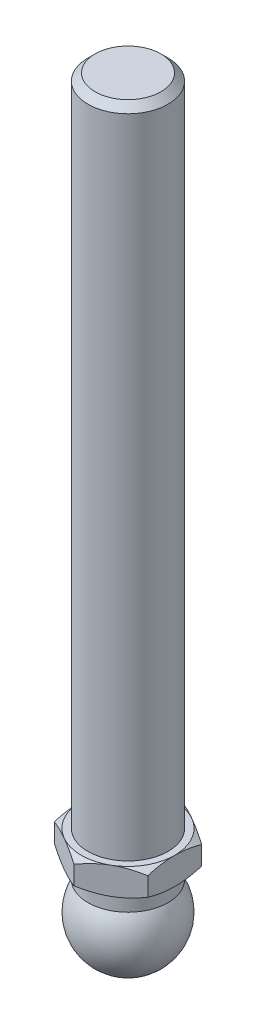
ISO-10303-21;
HEADER;
FILE_DESCRIPTION(('STEP AP214'),'2;1');
FILE_NAME('part.step','',(''),(''),'','','');
FILE_SCHEMA(('AUTOMOTIVE_DESIGN { 1 0 10303 214 1 1 1 1 }'));
ENDSEC;
DATA;
#1=APPLICATION_CONTEXT('core data for automotive mechanical design processes');
#2=APPLICATION_PROTOCOL_DEFINITION('international standard','automotive_design',2000,#1);
#3=PRODUCT_CONTEXT('',#1,'mechanical');
#4=PRODUCT('Part','Part','',(#3));
#5=PRODUCT_RELATED_PRODUCT_CATEGORY('part','',(#4));
#6=PRODUCT_DEFINITION_FORMATION('','',#4);
#7=PRODUCT_DEFINITION_CONTEXT('part definition',#1,'design');
#8=PRODUCT_DEFINITION('design','',#6,#7);
#9=PRODUCT_DEFINITION_SHAPE('','',#8);
#10=(LENGTH_UNIT() NAMED_UNIT(*) SI_UNIT(.MILLI.,.METRE.));
#11=(NAMED_UNIT(*) PLANE_ANGLE_UNIT() SI_UNIT($,.RADIAN.));
#12=(NAMED_UNIT(*) SI_UNIT($,.STERADIAN.) SOLID_ANGLE_UNIT());
#13=UNCERTAINTY_MEASURE_WITH_UNIT(LENGTH_MEASURE(1.E-05),#10,'distance_accuracy_value','');
#14=(GEOMETRIC_REPRESENTATION_CONTEXT(3) GLOBAL_UNCERTAINTY_ASSIGNED_CONTEXT((#13)) GLOBAL_UNIT_ASSIGNED_CONTEXT((#10,
#11,#12)) REPRESENTATION_CONTEXT('',''));
#15=CARTESIAN_POINT('',(0.,0.,0.));
#16=DIRECTION('',(0.,0.,1.));
#17=DIRECTION('',(1.,0.,0.));
#18=AXIS2_PLACEMENT_3D('',#15,#16,#17);
#19=CARTESIAN_POINT('',(0.,10.85,0.));
#20=DIRECTION('',(0.,-1.,0.));
#21=DIRECTION('',(0.,0.,-1.));
#22=AXIS2_PLACEMENT_3D('',#19,#20,#21);
#23=CONICAL_SURFACE('',#22,7.,1.0471975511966);
#24=CARTESIAN_POINT('',(-7.,6.78828268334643,12.1648696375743));
#25=CARTESIAN_POINT('',(-7.,6.93391573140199,11.8738003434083));
#26=CARTESIAN_POINT('',(-7.,7.07854589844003,11.5822239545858));
#27=CARTESIAN_POINT('',(-7.,7.36531569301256,10.997825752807));
#28=CARTESIAN_POINT('',(-7.,7.50745515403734,10.7050038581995));
#29=CARTESIAN_POINT('',(-7.,7.78902214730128,10.117331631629));
#30=CARTESIAN_POINT('',(-7.,7.92844364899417,9.82247840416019));
#31=CARTESIAN_POINT('',(-7.,8.20360604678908,9.23106328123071));
#32=CARTESIAN_POINT('',(-7.,8.33934701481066,8.9345014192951));
#33=CARTESIAN_POINT('',(-7.,8.61231104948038,8.325935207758));
#34=CARTESIAN_POINT('',(-7.,8.74932547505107,8.01383696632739));
#35=CARTESIAN_POINT('',(-7.,9.01713837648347,7.3869579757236));
#36=CARTESIAN_POINT('',(-7.,9.1479365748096,7.07217710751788));
#37=CARTESIAN_POINT('',(-7.,9.40155301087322,6.43962449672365));
#38=CARTESIAN_POINT('',(-7.,9.52437615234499,6.12185473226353));
#39=CARTESIAN_POINT('',(-7.,9.7599016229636,5.48260317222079));
#40=CARTESIAN_POINT('',(-7.,9.87260505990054,5.16112178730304));
#41=CARTESIAN_POINT('',(-7.,10.1099014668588,4.43821731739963));
#42=CARTESIAN_POINT('',(-7.,10.231118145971,4.03566892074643));
#43=CARTESIAN_POINT('',(-7.,10.4469740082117,3.22331060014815));
#44=CARTESIAN_POINT('',(-7.,10.5416155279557,2.81350131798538));
#45=CARTESIAN_POINT('',(-7.,10.6569999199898,2.19742561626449));
#46=CARTESIAN_POINT('',(-7.,10.6908518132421,1.99359214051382));
#47=CARTESIAN_POINT('',(-7.,10.7493191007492,1.5846161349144));
#48=CARTESIAN_POINT('',(-7.,10.7739358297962,1.37947379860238));
#49=CARTESIAN_POINT('',(-7.,10.8131968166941,0.968289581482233));
#50=CARTESIAN_POINT('',(-7.,10.8278439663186,0.762247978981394));
#51=CARTESIAN_POINT('',(-7.,10.8467021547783,0.349683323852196));
#52=CARTESIAN_POINT('',(-7.,10.8509132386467,0.143160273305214));
#53=CARTESIAN_POINT('',(-7.,10.8487493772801,-0.271082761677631));
#54=CARTESIAN_POINT('',(-7.,10.8423100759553,-0.478802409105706));
#55=CARTESIAN_POINT('',(-7.,10.8189433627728,-0.893645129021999));
#56=CARTESIAN_POINT('',(-7.,10.8020159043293,-1.10076819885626));
#57=CARTESIAN_POINT('',(-7.,10.7582124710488,-1.51403043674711));
#58=CARTESIAN_POINT('',(-7.,10.7313327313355,-1.72016920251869));
#59=CARTESIAN_POINT('',(-7.,10.6684180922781,-2.13103319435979));
#60=CARTESIAN_POINT('',(-7.,10.6323828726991,-2.33575837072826));
#61=CARTESIAN_POINT('',(-7.,10.5105686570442,-2.95437912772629));
#62=CARTESIAN_POINT('',(-7.,10.4118729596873,-3.36575077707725));
#63=CARTESIAN_POINT('',(-7.,10.1884533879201,-4.18138012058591));
#64=CARTESIAN_POINT('',(-7.,10.0637148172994,-4.58563365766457));
#65=CARTESIAN_POINT('',(-7.,9.82332483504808,-5.30320893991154));
#66=CARTESIAN_POINT('',(-7.,9.71128759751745,-5.61775957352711));
#67=CARTESIAN_POINT('',(-7.,9.47785144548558,-6.24325021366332));
#68=CARTESIAN_POINT('',(-7.,9.35645511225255,-6.55419118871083));
#69=CARTESIAN_POINT('',(-7.,9.1062070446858,-7.17328528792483));
#70=CARTESIAN_POINT('',(-7.,8.9773503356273,-7.48143638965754));
#71=CARTESIAN_POINT('',(-7.,8.71378231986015,-8.09523802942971));
#72=CARTESIAN_POINT('',(-7.,8.57907065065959,-8.40088841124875));
#73=CARTESIAN_POINT('',(-7.,8.31078407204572,-8.99716345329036));
#74=CARTESIAN_POINT('',(-7.,8.17740317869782,-9.28787568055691));
#75=CARTESIAN_POINT('',(-7.,7.90714715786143,-9.86766295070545));
#76=CARTESIAN_POINT('',(-7.,7.77027208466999,-10.1567380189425));
#77=CARTESIAN_POINT('',(-7.,7.49389786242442,-10.7329937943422));
#78=CARTESIAN_POINT('',(-7.,7.35440383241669,-11.0201769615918));
#79=CARTESIAN_POINT('',(-7.,7.07302286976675,-11.5933594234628));
#80=CARTESIAN_POINT('',(-7.,6.93113600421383,-11.879358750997));
#81=CARTESIAN_POINT('',(-7.,6.78828268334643,-12.1648696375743));
#82=B_SPLINE_CURVE_WITH_KNOTS('',3,(#24,#25,#26,#27,#28,#29,#30,#31,#32,#33,#34,#35,#36,#37,#38,
#39,#40,#41,#42,#43,#44,#45,#46,#47,#48,#49,#50,#51,#52,#53,#54,#55,#56,#57,#58,#59,#60,#61,#62,
#63,#64,#65,#66,#67,#68,#69,#70,#71,#72,#73,#74,#75,#76,#77,#78,#79,#80,#81),.UNSPECIFIED.,.F.,
.F.,(4,2,2,2,2,2,2,2,2,2,2,2,2,2,2,2,2,2,2,2,2,2,2,2,2,2,2,2,4),(0.,0.976413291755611,
1.95289161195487,2.93133423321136,3.90975772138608,4.93225217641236,5.95479223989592,
6.97669748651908,7.99849072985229,9.25906449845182,10.5195273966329,11.1392271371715,
11.7588372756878,12.3782676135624,12.9976952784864,13.6208795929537,14.2440666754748,
14.8674897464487,15.490934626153,16.758797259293,18.027377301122,19.0289263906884,
20.0302002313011,21.0321496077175,22.0341611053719,22.9936838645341,23.9531917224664,
24.9109871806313,25.8687558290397),.UNSPECIFIED.);
#83=CARTESIAN_POINT('',(-7.,10.2247852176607,4.04145188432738));
#84=VERTEX_POINT('',#83);
#85=CARTESIAN_POINT('',(-7.,10.85,0.));
#86=VERTEX_POINT('',#85);
#87=EDGE_CURVE('E313',#84,#86,#82,.T.);
#88=ORIENTED_EDGE('',*,*,#87,.F.);
#89=CARTESIAN_POINT('',(0.000200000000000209,10.2247185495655,8.0830192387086));
#90=CARTESIAN_POINT('',(-0.153667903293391,10.2760001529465,7.99418356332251));
#91=CARTESIAN_POINT('',(-0.30810950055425,10.3249544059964,7.90501666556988));
#92=CARTESIAN_POINT('',(-0.618246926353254,10.4175672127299,7.72595873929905));
#93=CARTESIAN_POINT('',(-0.773943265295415,10.4612234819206,7.63606741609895));
#94=CARTESIAN_POINT('',(-1.24352516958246,10.5833884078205,7.36495417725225));
#95=CARTESIAN_POINT('',(-1.5592643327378,10.652874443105,7.18266208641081));
#96=CARTESIAN_POINT('',(-2.03176224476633,10.7343550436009,6.9098652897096));
#97=CARTESIAN_POINT('',(-2.18710922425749,10.7575665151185,6.82017566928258));
#98=CARTESIAN_POINT('',(-2.49850511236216,10.7964887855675,6.64039116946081));
#99=CARTESIAN_POINT('',(-2.65455395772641,10.8122002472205,6.55029632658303));
#100=CARTESIAN_POINT('',(-2.96692267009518,10.8357220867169,6.36995016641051));
#101=CARTESIAN_POINT('',(-3.12324202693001,10.8435414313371,6.27969914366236));
#102=CARTESIAN_POINT('',(-3.43601650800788,10.8511197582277,6.09911871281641));
#103=CARTESIAN_POINT('',(-3.59247162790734,10.850878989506,6.00878930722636));
#104=CARTESIAN_POINT('',(-4.02110687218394,10.8391402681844,5.76131663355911));
#105=CARTESIAN_POINT('',(-4.2931466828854,10.8194342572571,5.60425437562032));
#106=CARTESIAN_POINT('',(-4.8354194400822,10.7569465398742,5.29117305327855));
#107=CARTESIAN_POINT('',(-5.10565047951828,10.714143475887,5.13515508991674));
#108=CARTESIAN_POINT('',(-5.64901454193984,10.6071483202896,4.82144370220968));
#109=CARTESIAN_POINT('',(-5.92207900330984,10.5425029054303,4.66378986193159));
#110=CARTESIAN_POINT('',(-6.46413578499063,10.395783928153,4.35083323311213));
#111=CARTESIAN_POINT('',(-6.73313504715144,10.3137448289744,4.19552643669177));
#112=CARTESIAN_POINT('',(-7.0002,10.2247185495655,4.04133641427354));
#113=B_SPLINE_CURVE_WITH_KNOTS('',3,(#89,#90,#91,#92,#93,#94,#95,#96,#97,#98,#99,#100,#101,#102,
#103,#104,#105,#106,#107,#108,#109,#110,#111,#112),.UNSPECIFIED.,.F.,.F.,(4,2,2,2,2,2,2,2,2,2,2,
4),(0.,0.554727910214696,1.10969417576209,2.2219327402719,2.76443041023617,3.30688013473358,
3.8487128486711,4.3905288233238,5.33376515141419,6.27787517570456,7.2429241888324,
8.20607866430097),.UNSPECIFIED.);
#114=CARTESIAN_POINT('',(-3.5,10.85,6.06217782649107));
#115=VERTEX_POINT('',#114);
#116=EDGE_CURVE('E135',#115,#84,#113,.T.);
#117=ORIENTED_EDGE('',*,*,#116,.F.);
#118=CARTESIAN_POINT('',(0.,10.85,0.));
#119=DIRECTION('',(0.,-1.,0.));
#120=DIRECTION('',(0.,0.,-1.));
#121=AXIS2_PLACEMENT_3D('',#118,#119,#120);
#122=CIRCLE('',#121,7.);
#123=EDGE_CURVE('E283',#115,#86,#122,.T.);
#124=ORIENTED_EDGE('',*,*,#123,.T.);
#125=EDGE_LOOP('',(#88,#117,#124));
#126=FACE_BOUND('',#125,.T.);
#127=ADVANCED_FACE('F14',(#126),#23,.T.);
#128=CARTESIAN_POINT('',(-7.,10.2247852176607,-4.04145188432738));
#129=VERTEX_POINT('',#128);
#130=EDGE_CURVE('E193',#86,#129,#82,.T.);
#131=ORIENTED_EDGE('',*,*,#130,.F.);
#132=CARTESIAN_POINT('',(-3.5,10.85,-6.06217782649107));
#133=VERTEX_POINT('',#132);
#134=EDGE_CURVE('E195',#86,#133,#122,.T.);
#135=ORIENTED_EDGE('',*,*,#134,.T.);
#136=CARTESIAN_POINT('',(-7.0002,10.2247185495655,-4.04133641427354));
#137=CARTESIAN_POINT('',(-6.84633209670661,10.2760001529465,-4.13017208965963));
#138=CARTESIAN_POINT('',(-6.69189049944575,10.3249544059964,-4.21933898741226));
#139=CARTESIAN_POINT('',(-6.38175307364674,10.4175672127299,-4.39839691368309));
#140=CARTESIAN_POINT('',(-6.22605673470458,10.4612234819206,-4.48828823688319));
#141=CARTESIAN_POINT('',(-5.75647483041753,10.5833884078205,-4.75940147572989));
#142=CARTESIAN_POINT('',(-5.4407356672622,10.652874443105,-4.94169356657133));
#143=CARTESIAN_POINT('',(-4.96823775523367,10.7343550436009,-5.21449036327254));
#144=CARTESIAN_POINT('',(-4.81289077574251,10.7575665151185,-5.30417998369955));
#145=CARTESIAN_POINT('',(-4.50149488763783,10.7964887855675,-5.48396448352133));
#146=CARTESIAN_POINT('',(-4.34544604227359,10.8122002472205,-5.57405932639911));
#147=CARTESIAN_POINT('',(-4.03307732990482,10.8357220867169,-5.75440548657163));
#148=CARTESIAN_POINT('',(-3.87675797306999,10.8435414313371,-5.84465650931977));
#149=CARTESIAN_POINT('',(-3.56398349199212,10.8511197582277,-6.02523694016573));
#150=CARTESIAN_POINT('',(-3.40752837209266,10.850878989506,-6.11556634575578));
#151=CARTESIAN_POINT('',(-2.97889312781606,10.8391402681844,-6.36303901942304));
#152=CARTESIAN_POINT('',(-2.7068533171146,10.8194342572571,-6.52010127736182));
#153=CARTESIAN_POINT('',(-2.1645805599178,10.7569465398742,-6.83318259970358));
#154=CARTESIAN_POINT('',(-1.89434952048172,10.714143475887,-6.9892005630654));
#155=CARTESIAN_POINT('',(-1.35098545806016,10.6071483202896,-7.30291195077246));
#156=CARTESIAN_POINT('',(-1.07792099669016,10.5425029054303,-7.46056579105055));
#157=CARTESIAN_POINT('',(-0.535864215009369,10.395783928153,-7.77352241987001));
#158=CARTESIAN_POINT('',(-0.266864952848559,10.3137448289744,-7.92882921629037));
#159=CARTESIAN_POINT('',(0.000200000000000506,10.2247185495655,-8.0830192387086));
#160=B_SPLINE_CURVE_WITH_KNOTS('',3,(#136,#137,#138,#139,#140,#141,#142,#143,#144,#145,#146,
#147,#148,#149,#150,#151,#152,#153,#154,#155,#156,#157,#158,#159),.UNSPECIFIED.,.F.,.F.,(4,2,2,
2,2,2,2,2,2,2,2,4),(0.,0.554727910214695,1.10969417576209,2.2219327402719,2.76443041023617,
3.30688013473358,3.8487128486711,4.39052882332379,5.33376515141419,6.27787517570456,
7.2429241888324,8.20607866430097),.UNSPECIFIED.);
#161=EDGE_CURVE('E183',#129,#133,#160,.T.);
#162=ORIENTED_EDGE('',*,*,#161,.F.);
#163=EDGE_LOOP('',(#131,#135,#162));
#164=FACE_BOUND('',#163,.T.);
#165=ADVANCED_FACE('F192',(#164),#23,.T.);
#166=CARTESIAN_POINT('',(0.,10.2247852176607,-8.08290376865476));
#167=VERTEX_POINT('',#166);
#168=EDGE_CURVE('E197',#133,#167,#160,.T.);
#169=ORIENTED_EDGE('',*,*,#168,.F.);
#170=CARTESIAN_POINT('',(3.5,10.85,-6.06217782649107));
#171=VERTEX_POINT('',#170);
#172=EDGE_CURVE('E293',#133,#171,#122,.T.);
#173=ORIENTED_EDGE('',*,*,#172,.T.);
#174=CARTESIAN_POINT('',(-0.000200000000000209,10.2247185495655,-8.0830192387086));
#175=CARTESIAN_POINT('',(0.153667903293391,10.2760001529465,-7.99418356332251));
#176=CARTESIAN_POINT('',(0.30810950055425,10.3249544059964,-7.90501666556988));
#177=CARTESIAN_POINT('',(0.618246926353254,10.4175672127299,-7.72595873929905));
#178=CARTESIAN_POINT('',(0.773943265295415,10.4612234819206,-7.63606741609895));
#179=CARTESIAN_POINT('',(1.24352516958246,10.5833884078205,-7.36495417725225));
#180=CARTESIAN_POINT('',(1.5592643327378,10.652874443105,-7.18266208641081));
#181=CARTESIAN_POINT('',(2.03176224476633,10.7343550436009,-6.9098652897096));
#182=CARTESIAN_POINT('',(2.18710922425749,10.7575665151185,-6.82017566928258));
#183=CARTESIAN_POINT('',(2.49850511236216,10.7964887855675,-6.64039116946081));
#184=CARTESIAN_POINT('',(2.65455395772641,10.8122002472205,-6.55029632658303));
#185=CARTESIAN_POINT('',(2.96692267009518,10.8357220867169,-6.36995016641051));
#186=CARTESIAN_POINT('',(3.12324202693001,10.8435414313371,-6.27969914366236));
#187=CARTESIAN_POINT('',(3.43601650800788,10.8511197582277,-6.09911871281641));
#188=CARTESIAN_POINT('',(3.59247162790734,10.850878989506,-6.00878930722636));
#189=CARTESIAN_POINT('',(4.02110687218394,10.8391402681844,-5.76131663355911));
#190=CARTESIAN_POINT('',(4.2931466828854,10.8194342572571,-5.60425437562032));
#191=CARTESIAN_POINT('',(4.8354194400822,10.7569465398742,-5.29117305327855));
#192=CARTESIAN_POINT('',(5.10565047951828,10.714143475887,-5.13515508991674));
#193=CARTESIAN_POINT('',(5.64901454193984,10.6071483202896,-4.82144370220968));
#194=CARTESIAN_POINT('',(5.92207900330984,10.5425029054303,-4.66378986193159));
#195=CARTESIAN_POINT('',(6.46413578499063,10.395783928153,-4.35083323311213));
#196=CARTESIAN_POINT('',(6.73313504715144,10.3137448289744,-4.19552643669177));
#197=CARTESIAN_POINT('',(7.0002,10.2247185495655,-4.04133641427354));
#198=B_SPLINE_CURVE_WITH_KNOTS('',3,(#174,#175,#176,#177,#178,#179,#180,#181,#182,#183,#184,
#185,#186,#187,#188,#189,#190,#191,#192,#193,#194,#195,#196,#197),.UNSPECIFIED.,.F.,.F.,(4,2,2,
2,2,2,2,2,2,2,2,4),(0.,0.554727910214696,1.10969417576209,2.2219327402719,2.76443041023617,
3.30688013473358,3.8487128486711,4.3905288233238,5.33376515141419,6.27787517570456,
7.2429241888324,8.20607866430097),.UNSPECIFIED.);
#199=EDGE_CURVE('E243',#167,#171,#198,.T.);
#200=ORIENTED_EDGE('',*,*,#199,.F.);
#201=EDGE_LOOP('',(#169,#173,#200));
#202=FACE_BOUND('',#201,.T.);
#203=ADVANCED_FACE('F346',(#202),#23,.T.);
#204=CARTESIAN_POINT('',(7.,10.2247852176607,-4.04145188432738));
#205=VERTEX_POINT('',#204);
#206=EDGE_CURVE('E238',#171,#205,#198,.T.);
#207=ORIENTED_EDGE('',*,*,#206,.F.);
#208=CARTESIAN_POINT('',(7.,10.85,0.));
#209=VERTEX_POINT('',#208);
#210=EDGE_CURVE('E288',#171,#209,#122,.T.);
#211=ORIENTED_EDGE('',*,*,#210,.T.);
#212=CARTESIAN_POINT('',(7.,6.78828268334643,-12.1648696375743));
#213=CARTESIAN_POINT('',(7.,6.93391573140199,-11.8738003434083));
#214=CARTESIAN_POINT('',(7.,7.07854589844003,-11.5822239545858));
#215=CARTESIAN_POINT('',(7.,7.36531569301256,-10.997825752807));
#216=CARTESIAN_POINT('',(7.,7.50745515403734,-10.7050038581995));
#217=CARTESIAN_POINT('',(7.,7.78902214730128,-10.117331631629));
#218=CARTESIAN_POINT('',(7.,7.92844364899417,-9.82247840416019));
#219=CARTESIAN_POINT('',(7.,8.20360604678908,-9.23106328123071));
#220=CARTESIAN_POINT('',(7.,8.33934701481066,-8.9345014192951));
#221=CARTESIAN_POINT('',(7.,8.61231104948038,-8.325935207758));
#222=CARTESIAN_POINT('',(7.,8.74932547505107,-8.01383696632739));
#223=CARTESIAN_POINT('',(7.,9.01713837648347,-7.3869579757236));
#224=CARTESIAN_POINT('',(7.,9.1479365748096,-7.07217710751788));
#225=CARTESIAN_POINT('',(7.,9.40155301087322,-6.43962449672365));
#226=CARTESIAN_POINT('',(7.,9.52437615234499,-6.12185473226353));
#227=CARTESIAN_POINT('',(7.,9.7599016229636,-5.48260317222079));
#228=CARTESIAN_POINT('',(7.,9.87260505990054,-5.16112178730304));
#229=CARTESIAN_POINT('',(7.,10.1099014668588,-4.43821731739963));
#230=CARTESIAN_POINT('',(7.,10.231118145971,-4.03566892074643));
#231=CARTESIAN_POINT('',(7.,10.4469740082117,-3.22331060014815));
#232=CARTESIAN_POINT('',(7.,10.5416155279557,-2.81350131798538));
#233=CARTESIAN_POINT('',(7.,10.6569999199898,-2.19742561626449));
#234=CARTESIAN_POINT('',(7.,10.6908518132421,-1.99359214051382));
#235=CARTESIAN_POINT('',(7.,10.7493191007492,-1.5846161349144));
#236=CARTESIAN_POINT('',(7.,10.7739358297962,-1.37947379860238));
#237=CARTESIAN_POINT('',(7.,10.8131968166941,-0.968289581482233));
#238=CARTESIAN_POINT('',(7.,10.8278439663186,-0.762247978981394));
#239=CARTESIAN_POINT('',(7.,10.8467021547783,-0.349683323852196));
#240=CARTESIAN_POINT('',(7.,10.8509132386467,-0.143160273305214));
#241=CARTESIAN_POINT('',(7.,10.8487493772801,0.271082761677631));
#242=CARTESIAN_POINT('',(7.,10.8423100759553,0.478802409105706));
#243=CARTESIAN_POINT('',(7.,10.8189433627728,0.893645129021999));
#244=CARTESIAN_POINT('',(7.,10.8020159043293,1.10076819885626));
#245=CARTESIAN_POINT('',(7.,10.7582124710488,1.51403043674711));
#246=CARTESIAN_POINT('',(7.,10.7313327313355,1.72016920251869));
#247=CARTESIAN_POINT('',(7.,10.6684180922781,2.13103319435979));
#248=CARTESIAN_POINT('',(7.,10.6323828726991,2.33575837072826));
#249=CARTESIAN_POINT('',(7.,10.5105686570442,2.95437912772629));
#250=CARTESIAN_POINT('',(7.,10.4118729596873,3.36575077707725));
#251=CARTESIAN_POINT('',(7.,10.1884533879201,4.18138012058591));
#252=CARTESIAN_POINT('',(7.,10.0637148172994,4.58563365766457));
#253=CARTESIAN_POINT('',(7.,9.82332483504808,5.30320893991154));
#254=CARTESIAN_POINT('',(7.,9.71128759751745,5.61775957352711));
#255=CARTESIAN_POINT('',(7.,9.47785144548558,6.24325021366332));
#256=CARTESIAN_POINT('',(7.,9.35645511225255,6.55419118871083));
#257=CARTESIAN_POINT('',(7.,9.1062070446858,7.17328528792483));
#258=CARTESIAN_POINT('',(7.,8.9773503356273,7.48143638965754));
#259=CARTESIAN_POINT('',(7.,8.71378231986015,8.09523802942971));
#260=CARTESIAN_POINT('',(7.,8.57907065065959,8.40088841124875));
#261=CARTESIAN_POINT('',(7.,8.31078407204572,8.99716345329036));
#262=CARTESIAN_POINT('',(7.,8.17740317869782,9.28787568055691));
#263=CARTESIAN_POINT('',(7.,7.90714715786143,9.86766295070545));
#264=CARTESIAN_POINT('',(7.,7.77027208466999,10.1567380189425));
#265=CARTESIAN_POINT('',(7.,7.49389786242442,10.7329937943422));
#266=CARTESIAN_POINT('',(7.,7.35440383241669,11.0201769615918));
#267=CARTESIAN_POINT('',(7.,7.07302286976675,11.5933594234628));
#268=CARTESIAN_POINT('',(7.,6.93113600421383,11.879358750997));
#269=CARTESIAN_POINT('',(7.,6.78828268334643,12.1648696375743));
#270=B_SPLINE_CURVE_WITH_KNOTS('',3,(#212,#213,#214,#215,#216,#217,#218,#219,#220,#221,#222,
#223,#224,#225,#226,#227,#228,#229,#230,#231,#232,#233,#234,#235,#236,#237,#238,#239,#240,#241,
#242,#243,#244,#245,#246,#247,#248,#249,#250,#251,#252,#253,#254,#255,#256,#257,#258,#259,#260,
#261,#262,#263,#264,#265,#266,#267,#268,#269),.UNSPECIFIED.,.F.,.F.,(4,2,2,2,2,2,2,2,2,2,2,2,2,
2,2,2,2,2,2,2,2,2,2,2,2,2,2,2,4),(0.,0.976413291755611,1.95289161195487,2.93133423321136,
3.90975772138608,4.93225217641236,5.95479223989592,6.97669748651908,7.99849072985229,
9.25906449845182,10.5195273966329,11.1392271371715,11.7588372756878,12.3782676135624,
12.9976952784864,13.6208795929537,14.2440666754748,14.8674897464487,15.490934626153,
16.758797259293,18.027377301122,19.0289263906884,20.0302002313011,21.0321496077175,
22.0341611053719,22.9936838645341,23.9531917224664,24.9109871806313,25.8687558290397),.UNSPECIFIED.);
#271=EDGE_CURVE('E249',#205,#209,#270,.T.);
#272=ORIENTED_EDGE('',*,*,#271,.F.);
#273=EDGE_LOOP('',(#207,#211,#272));
#274=FACE_BOUND('',#273,.T.);
#275=ADVANCED_FACE('F356',(#274),#23,.T.);
#276=CARTESIAN_POINT('',(7.,10.2247852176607,4.04145188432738));
#277=VERTEX_POINT('',#276);
#278=EDGE_CURVE('E251',#209,#277,#270,.T.);
#279=ORIENTED_EDGE('',*,*,#278,.F.);
#280=CARTESIAN_POINT('',(3.5,10.85,6.06217782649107));
#281=VERTEX_POINT('',#280);
#282=EDGE_CURVE('E281',#209,#281,#122,.T.);
#283=ORIENTED_EDGE('',*,*,#282,.T.);
#284=CARTESIAN_POINT('',(7.0002,10.2247185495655,4.04133641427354));
#285=CARTESIAN_POINT('',(6.84633209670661,10.2760001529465,4.13017208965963));
#286=CARTESIAN_POINT('',(6.69189049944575,10.3249544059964,4.21933898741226));
#287=CARTESIAN_POINT('',(6.38175307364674,10.4175672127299,4.39839691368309));
#288=CARTESIAN_POINT('',(6.22605673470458,10.4612234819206,4.48828823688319));
#289=CARTESIAN_POINT('',(5.75647483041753,10.5833884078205,4.75940147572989));
#290=CARTESIAN_POINT('',(5.4407356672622,10.652874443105,4.94169356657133));
#291=CARTESIAN_POINT('',(4.96823775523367,10.7343550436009,5.21449036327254));
#292=CARTESIAN_POINT('',(4.81289077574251,10.7575665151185,5.30417998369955));
#293=CARTESIAN_POINT('',(4.50149488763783,10.7964887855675,5.48396448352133));
#294=CARTESIAN_POINT('',(4.34544604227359,10.8122002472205,5.57405932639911));
#295=CARTESIAN_POINT('',(4.03307732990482,10.8357220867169,5.75440548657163));
#296=CARTESIAN_POINT('',(3.87675797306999,10.8435414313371,5.84465650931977));
#297=CARTESIAN_POINT('',(3.56398349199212,10.8511197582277,6.02523694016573));
#298=CARTESIAN_POINT('',(3.40752837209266,10.850878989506,6.11556634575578));
#299=CARTESIAN_POINT('',(2.97889312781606,10.8391402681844,6.36303901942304));
#300=CARTESIAN_POINT('',(2.7068533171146,10.8194342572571,6.52010127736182));
#301=CARTESIAN_POINT('',(2.1645805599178,10.7569465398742,6.83318259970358));
#302=CARTESIAN_POINT('',(1.89434952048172,10.714143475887,6.9892005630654));
#303=CARTESIAN_POINT('',(1.35098545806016,10.6071483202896,7.30291195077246));
#304=CARTESIAN_POINT('',(1.07792099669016,10.5425029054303,7.46056579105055));
#305=CARTESIAN_POINT('',(0.535864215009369,10.395783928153,7.77352241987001));
#306=CARTESIAN_POINT('',(0.266864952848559,10.3137448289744,7.92882921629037));
#307=CARTESIAN_POINT('',(-0.000200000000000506,10.2247185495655,8.0830192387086));
#308=B_SPLINE_CURVE_WITH_KNOTS('',3,(#284,#285,#286,#287,#288,#289,#290,#291,#292,#293,#294,
#295,#296,#297,#298,#299,#300,#301,#302,#303,#304,#305,#306,#307),.UNSPECIFIED.,.F.,.F.,(4,2,2,
2,2,2,2,2,2,2,2,4),(0.,0.554727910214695,1.10969417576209,2.2219327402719,2.76443041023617,
3.30688013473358,3.8487128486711,4.39052882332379,5.33376515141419,6.27787517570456,
7.2429241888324,8.20607866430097),.UNSPECIFIED.);
#309=EDGE_CURVE('E126',#277,#281,#308,.T.);
#310=ORIENTED_EDGE('',*,*,#309,.F.);
#311=EDGE_LOOP('',(#279,#283,#310));
#312=FACE_BOUND('',#311,.T.);
#313=ADVANCED_FACE('F285',(#312),#23,.T.);
#314=CARTESIAN_POINT('',(0.,10.2247852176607,8.08290376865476));
#315=VERTEX_POINT('',#314);
#316=EDGE_CURVE('E116',#281,#315,#308,.T.);
#317=ORIENTED_EDGE('',*,*,#316,.F.);
#318=EDGE_CURVE('E274',#281,#115,#122,.T.);
#319=ORIENTED_EDGE('',*,*,#318,.T.);
#320=EDGE_CURVE('E29',#315,#115,#113,.T.);
#321=ORIENTED_EDGE('',*,*,#320,.F.);
#322=EDGE_LOOP('',(#317,#319,#321));
#323=FACE_BOUND('',#322,.T.);
#324=ADVANCED_FACE('F273',(#323),#23,.T.);
#325=CARTESIAN_POINT('',(0.,108.85,0.));
#326=DIRECTION('',(0.,-1.,0.));
#327=DIRECTION('',(0.,0.,-1.));
#328=AXIS2_PLACEMENT_3D('',#325,#326,#327);
#329=PLANE('',#328);
#330=CARTESIAN_POINT('',(0.,108.85,0.));
#331=DIRECTION('',(0.,-1.,0.));
#332=DIRECTION('',(0.,0.,-1.));
#333=AXIS2_PLACEMENT_3D('',#330,#331,#332);
#334=CIRCLE('',#333,4.9265);
#335=CARTESIAN_POINT('',(0.,108.85,-4.9265));
#336=VERTEX_POINT('',#335);
#337=EDGE_CURVE('E22',#336,#336,#334,.T.);
#338=ORIENTED_EDGE('',*,*,#337,.F.);
#339=EDGE_LOOP('',(#338));
#340=FACE_BOUND('',#339,.T.);
#341=ADVANCED_FACE('F16',(#340),#329,.F.);
#342=CARTESIAN_POINT('',(0.,108.85,0.));
#343=DIRECTION('',(0.,-1.,0.));
#344=DIRECTION('',(0.,0.,-1.));
#345=AXIS2_PLACEMENT_3D('',#342,#343,#344);
#346=CONICAL_SURFACE('',#345,4.9265,0.785398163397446);
#347=CARTESIAN_POINT('',(0.,107.7765,0.));
#348=DIRECTION('',(0.,-1.,0.));
#349=DIRECTION('',(0.,0.,-1.));
#350=AXIS2_PLACEMENT_3D('',#347,#348,#349);
#351=CIRCLE('',#350,6.);
#352=CARTESIAN_POINT('',(0.,107.7765,-6.));
#353=VERTEX_POINT('',#352);
#354=EDGE_CURVE('E290',#353,#353,#351,.T.);
#355=ORIENTED_EDGE('',*,*,#354,.F.);
#356=EDGE_LOOP('',(#355));
#357=FACE_BOUND('',#356,.T.);
#358=ORIENTED_EDGE('',*,*,#337,.T.);
#359=EDGE_LOOP('',(#358));
#360=FACE_BOUND('',#359,.T.);
#361=ADVANCED_FACE('F354',(#357,#360),#346,.T.);
#362=CARTESIAN_POINT('',(0.,-7.,0.));
#363=DIRECTION('',(0.,-1.,0.));
#364=DIRECTION('',(0.,0.,-1.));
#365=AXIS2_PLACEMENT_3D('',#362,#363,#364);
#366=CYLINDRICAL_SURFACE('',#365,6.);
#367=CARTESIAN_POINT('',(0.,10.85,0.));
#368=DIRECTION('',(0.,-1.,0.));
#369=DIRECTION('',(0.,0.,-1.));
#370=AXIS2_PLACEMENT_3D('',#367,#368,#369);
#371=CIRCLE('',#370,6.);
#372=CARTESIAN_POINT('',(0.,10.85,-6.));
#373=VERTEX_POINT('',#372);
#374=EDGE_CURVE('E287',#373,#373,#371,.T.);
#375=ORIENTED_EDGE('',*,*,#374,.F.);
#376=EDGE_LOOP('',(#375));
#377=FACE_BOUND('',#376,.T.);
#378=ORIENTED_EDGE('',*,*,#354,.T.);
#379=EDGE_LOOP('',(#378));
#380=FACE_BOUND('',#379,.T.);
#381=ADVANCED_FACE('F439',(#377,#380),#366,.T.);
#382=CARTESIAN_POINT('',(6.,10.85,0.));
#383=DIRECTION('',(0.,-1.,0.));
#384=DIRECTION('',(0.,0.,-1.));
#385=AXIS2_PLACEMENT_3D('',#382,#383,#384);
#386=PLANE('',#385);
#387=ORIENTED_EDGE('',*,*,#282,.F.);
#388=ORIENTED_EDGE('',*,*,#210,.F.);
#389=ORIENTED_EDGE('',*,*,#172,.F.);
#390=ORIENTED_EDGE('',*,*,#134,.F.);
#391=ORIENTED_EDGE('',*,*,#123,.F.);
#392=ORIENTED_EDGE('',*,*,#318,.F.);
#393=EDGE_LOOP('',(#387,#388,#389,#390,#391,#392));
#394=FACE_BOUND('',#393,.T.);
#395=ORIENTED_EDGE('',*,*,#374,.T.);
#396=EDGE_LOOP('',(#395));
#397=FACE_BOUND('',#396,.T.);
#398=ADVANCED_FACE('F278',(#394,#397),#386,.F.);
#399=CARTESIAN_POINT('',(-7.,6.8,-4.04145188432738));
#400=DIRECTION('',(-1.,0.,0.));
#401=DIRECTION('',(0.,0.,1.));
#402=AXIS2_PLACEMENT_3D('',#399,#400,#401);
#403=PLANE('',#402);
#404=ORIENTED_EDGE('',*,*,#87,.T.);
#405=ORIENTED_EDGE('',*,*,#130,.T.);
#406=DIRECTION('',(0.,1.,0.));
#407=VECTOR('',#406,1.);
#408=CARTESIAN_POINT('',(-7.,6.8,-4.04145188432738));
#409=LINE('',#408,#407);
#410=CARTESIAN_POINT('',(-7.,7.42521478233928,-4.04145188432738));
#411=VERTEX_POINT('',#410);
#412=EDGE_CURVE('E109',#411,#129,#409,.T.);
#413=ORIENTED_EDGE('',*,*,#412,.F.);
#414=CARTESIAN_POINT('',(-7.,10.8617173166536,-12.1648696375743));
#415=CARTESIAN_POINT('',(-7.,10.716084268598,-11.8738003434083));
#416=CARTESIAN_POINT('',(-7.,10.57145410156,-11.5822239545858));
#417=CARTESIAN_POINT('',(-7.,10.2846843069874,-10.997825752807));
#418=CARTESIAN_POINT('',(-7.,10.1425448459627,-10.7050038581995));
#419=CARTESIAN_POINT('',(-7.,9.86097785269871,-10.117331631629));
#420=CARTESIAN_POINT('',(-7.,9.72155635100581,-9.82247840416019));
#421=CARTESIAN_POINT('',(-7.,9.4463939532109,-9.2310632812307));
#422=CARTESIAN_POINT('',(-7.,9.31065298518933,-8.93450141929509));
#423=CARTESIAN_POINT('',(-7.,9.03768895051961,-8.32593520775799));
#424=CARTESIAN_POINT('',(-7.,8.90067452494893,-8.01383696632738));
#425=CARTESIAN_POINT('',(-7.,8.63286162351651,-7.38695797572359));
#426=CARTESIAN_POINT('',(-7.,8.50206342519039,-7.07217710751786));
#427=CARTESIAN_POINT('',(-7.,8.24844698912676,-6.43962449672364));
#428=CARTESIAN_POINT('',(-7.,8.12562384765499,-6.12185473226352));
#429=CARTESIAN_POINT('',(-7.,7.89009837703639,-5.48260317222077));
#430=CARTESIAN_POINT('',(-7.,7.77739494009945,-5.16112178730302));
#431=CARTESIAN_POINT('',(-7.,7.54009853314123,-4.43821731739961));
#432=CARTESIAN_POINT('',(-7.,7.41888185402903,-4.03566892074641));
#433=CARTESIAN_POINT('',(-7.,7.20302599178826,-3.22331060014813));
#434=CARTESIAN_POINT('',(-7.,7.10838447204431,-2.81350131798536));
#435=CARTESIAN_POINT('',(-7.,6.99300008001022,-2.19742561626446));
#436=CARTESIAN_POINT('',(-7.,6.9591481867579,-1.99359214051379));
#437=CARTESIAN_POINT('',(-7.,6.90068089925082,-1.58461613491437));
#438=CARTESIAN_POINT('',(-7.,6.87606417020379,-1.37947379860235));
#439=CARTESIAN_POINT('',(-7.,6.83680318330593,-0.968289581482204));
#440=CARTESIAN_POINT('',(-7.,6.82215603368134,-0.762247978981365));
#441=CARTESIAN_POINT('',(-7.,6.80329784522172,-0.349683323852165));
#442=CARTESIAN_POINT('',(-7.,6.79908676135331,-0.143160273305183));
#443=CARTESIAN_POINT('',(-7.,6.80125062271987,0.271082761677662));
#444=CARTESIAN_POINT('',(-7.,6.80768992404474,0.478802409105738));
#445=CARTESIAN_POINT('',(-7.,6.8310566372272,0.893645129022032));
#446=CARTESIAN_POINT('',(-7.,6.84798409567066,1.10076819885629));
#447=CARTESIAN_POINT('',(-7.,6.89178752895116,1.51403043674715));
#448=CARTESIAN_POINT('',(-7.,6.9186672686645,1.72016920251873));
#449=CARTESIAN_POINT('',(-7.,6.98158190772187,2.13103319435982));
#450=CARTESIAN_POINT('',(-7.,7.01761712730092,2.3357583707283));
#451=CARTESIAN_POINT('',(-7.,7.13943134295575,2.95437912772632));
#452=CARTESIAN_POINT('',(-7.,7.23812704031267,3.36575077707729));
#453=CARTESIAN_POINT('',(-7.,7.46154661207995,4.18138012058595));
#454=CARTESIAN_POINT('',(-7.,7.58628518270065,4.58563365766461));
#455=CARTESIAN_POINT('',(-7.,7.82667516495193,5.30320893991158));
#456=CARTESIAN_POINT('',(-7.,7.93871240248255,5.61775957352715));
#457=CARTESIAN_POINT('',(-7.,8.17214855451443,6.24325021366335));
#458=CARTESIAN_POINT('',(-7.,8.29354488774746,6.55419118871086));
#459=CARTESIAN_POINT('',(-7.,8.5437929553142,7.17328528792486));
#460=CARTESIAN_POINT('',(-7.,8.67264966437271,7.48143638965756));
#461=CARTESIAN_POINT('',(-7.,8.93621768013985,8.09523802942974));
#462=CARTESIAN_POINT('',(-7.,9.07092934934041,8.40088841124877));
#463=CARTESIAN_POINT('',(-7.,9.33921592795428,8.99716345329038));
#464=CARTESIAN_POINT('',(-7.,9.47259682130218,9.28787568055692));
#465=CARTESIAN_POINT('',(-7.,9.74285284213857,9.86766295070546));
#466=CARTESIAN_POINT('',(-7.,9.87972791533,10.1567380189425));
#467=CARTESIAN_POINT('',(-7.,10.1561021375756,10.7329937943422));
#468=CARTESIAN_POINT('',(-7.,10.2955961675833,11.0201769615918));
#469=CARTESIAN_POINT('',(-7.,10.5769771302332,11.5933594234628));
#470=CARTESIAN_POINT('',(-7.,10.7188639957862,11.879358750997));
#471=CARTESIAN_POINT('',(-7.,10.8617173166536,12.1648696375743));
#472=B_SPLINE_CURVE_WITH_KNOTS('',3,(#414,#415,#416,#417,#418,#419,#420,#421,#422,#423,#424,
#425,#426,#427,#428,#429,#430,#431,#432,#433,#434,#435,#436,#437,#438,#439,#440,#441,#442,#443,
#444,#445,#446,#447,#448,#449,#450,#451,#452,#453,#454,#455,#456,#457,#458,#459,#460,#461,#462,
#463,#464,#465,#466,#467,#468,#469,#470,#471),.UNSPECIFIED.,.F.,.F.,(4,2,2,2,2,2,2,2,2,2,2,2,2,
2,2,2,2,2,2,2,2,2,2,2,2,2,2,2,4),(0.,0.97641329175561,1.95289161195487,2.93133423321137,
3.90975772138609,4.93225217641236,5.95479223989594,6.9766974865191,7.99849072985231,
9.25906449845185,10.5195273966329,11.1392271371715,11.7588372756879,12.3782676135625,
12.9976952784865,13.6208795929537,14.2440666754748,14.8674897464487,15.490934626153,
16.758797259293,18.0273773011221,19.0289263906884,20.0302002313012,21.0321496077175,
22.0341611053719,22.9936838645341,23.9531917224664,24.9109871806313,25.8687558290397),.UNSPECIFIED.);
#473=CARTESIAN_POINT('',(-7.,6.8,0.));
#474=VERTEX_POINT('',#473);
#475=EDGE_CURVE('E199',#411,#474,#472,.T.);
#476=ORIENTED_EDGE('',*,*,#475,.T.);
#477=CARTESIAN_POINT('',(-7.,7.42521478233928,4.04145188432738));
#478=VERTEX_POINT('',#477);
#479=EDGE_CURVE('E196',#474,#478,#472,.T.);
#480=ORIENTED_EDGE('',*,*,#479,.T.);
#481=DIRECTION('',(0.,1.,0.));
#482=VECTOR('',#481,1.);
#483=CARTESIAN_POINT('',(-7.,6.8,4.04145188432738));
#484=LINE('',#483,#482);
#485=EDGE_CURVE('E118',#478,#84,#484,.T.);
#486=ORIENTED_EDGE('',*,*,#485,.T.);
#487=EDGE_LOOP('',(#404,#405,#413,#476,#480,#486));
#488=FACE_BOUND('',#487,.T.);
#489=ADVANCED_FACE('F224',(#488),#403,.T.);
#490=CARTESIAN_POINT('',(0.,6.8,-8.08290376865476));
#491=DIRECTION('',(-0.5,0.,-0.866025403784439));
#492=DIRECTION('',(-0.866025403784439,0.,0.5));
#493=AXIS2_PLACEMENT_3D('',#490,#491,#492);
#494=PLANE('',#493);
#495=ORIENTED_EDGE('',*,*,#161,.T.);
#496=ORIENTED_EDGE('',*,*,#168,.T.);
#497=DIRECTION('',(0.,1.,0.));
#498=VECTOR('',#497,1.);
#499=CARTESIAN_POINT('',(0.,6.8,-8.08290376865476));
#500=LINE('',#499,#498);
#501=CARTESIAN_POINT('',(0.,7.42521478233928,-8.08290376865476));
#502=VERTEX_POINT('',#501);
#503=EDGE_CURVE('E175',#502,#167,#500,.T.);
#504=ORIENTED_EDGE('',*,*,#503,.F.);
#505=CARTESIAN_POINT('',(0.00020000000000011,7.4252814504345,-8.0830192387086));
#506=CARTESIAN_POINT('',(-0.15366790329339,7.37399984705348,-7.99418356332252));
#507=CARTESIAN_POINT('',(-0.308109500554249,7.32504559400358,-7.90501666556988));
#508=CARTESIAN_POINT('',(-0.618246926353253,7.23243278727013,-7.72595873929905));
#509=CARTESIAN_POINT('',(-0.773943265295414,7.18877651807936,-7.63606741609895));
#510=CARTESIAN_POINT('',(-1.24352516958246,7.06661159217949,-7.36495417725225));
#511=CARTESIAN_POINT('',(-1.5592643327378,6.99712555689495,-7.18266208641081));
#512=CARTESIAN_POINT('',(-2.03176224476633,6.91564495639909,-6.9098652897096));
#513=CARTESIAN_POINT('',(-2.18710922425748,6.89243348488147,-6.82017566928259));
#514=CARTESIAN_POINT('',(-2.49850511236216,6.85351121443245,-6.64039116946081));
#515=CARTESIAN_POINT('',(-2.65455395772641,6.83779975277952,-6.55029632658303));
#516=CARTESIAN_POINT('',(-2.96692267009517,6.81427791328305,-6.36995016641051));
#517=CARTESIAN_POINT('',(-3.12324202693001,6.80645856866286,-6.27969914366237));
#518=CARTESIAN_POINT('',(-3.43601650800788,6.7988802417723,-6.09911871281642));
#519=CARTESIAN_POINT('',(-3.59247162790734,6.79912101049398,-6.00878930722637));
#520=CARTESIAN_POINT('',(-4.02110687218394,6.8108597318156,-5.76131663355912));
#521=CARTESIAN_POINT('',(-4.2931466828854,6.83056574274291,-5.60425437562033));
#522=CARTESIAN_POINT('',(-4.8354194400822,6.89305346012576,-5.29117305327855));
#523=CARTESIAN_POINT('',(-5.10565047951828,6.93585652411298,-5.13515508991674));
#524=CARTESIAN_POINT('',(-5.64901454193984,7.04285167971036,-4.82144370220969));
#525=CARTESIAN_POINT('',(-5.92207900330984,7.10749709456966,-4.66378986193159));
#526=CARTESIAN_POINT('',(-6.46413578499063,7.25421607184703,-4.35083323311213));
#527=CARTESIAN_POINT('',(-6.73313504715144,7.33625517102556,-4.19552643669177));
#528=CARTESIAN_POINT('',(-7.0002,7.4252814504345,-4.04133641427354));
#529=B_SPLINE_CURVE_WITH_KNOTS('',3,(#505,#506,#507,#508,#509,#510,#511,#512,#513,#514,#515,
#516,#517,#518,#519,#520,#521,#522,#523,#524,#525,#526,#527,#528),.UNSPECIFIED.,.F.,.F.,(4,2,2,
2,2,2,2,2,2,2,2,4),(0.,0.554727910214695,1.10969417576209,2.2219327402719,2.76443041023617,
3.30688013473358,3.8487128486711,4.39052882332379,5.33376515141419,6.27787517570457,
7.2429241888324,8.20607866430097),.UNSPECIFIED.);
#530=CARTESIAN_POINT('',(-3.5,6.8,-6.06217782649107));
#531=VERTEX_POINT('',#530);
#532=EDGE_CURVE('E201',#502,#531,#529,.T.);
#533=ORIENTED_EDGE('',*,*,#532,.T.);
#534=EDGE_CURVE('E186',#531,#411,#529,.T.);
#535=ORIENTED_EDGE('',*,*,#534,.T.);
#536=ORIENTED_EDGE('',*,*,#412,.T.);
#537=EDGE_LOOP('',(#495,#496,#504,#533,#535,#536));
#538=FACE_BOUND('',#537,.T.);
#539=ADVANCED_FACE('F182',(#538),#494,.T.);
#540=CARTESIAN_POINT('',(7.,6.8,-4.04145188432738));
#541=DIRECTION('',(0.5,0.,-0.866025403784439));
#542=DIRECTION('',(-0.866025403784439,0.,-0.5));
#543=AXIS2_PLACEMENT_3D('',#540,#541,#542);
#544=PLANE('',#543);
#545=ORIENTED_EDGE('',*,*,#199,.T.);
#546=ORIENTED_EDGE('',*,*,#206,.T.);
#547=DIRECTION('',(0.,1.,0.));
#548=VECTOR('',#547,1.);
#549=CARTESIAN_POINT('',(7.,6.8,-4.04145188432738));
#550=LINE('',#549,#548);
#551=CARTESIAN_POINT('',(7.,7.42521478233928,-4.04145188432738));
#552=VERTEX_POINT('',#551);
#553=EDGE_CURVE('E172',#552,#205,#550,.T.);
#554=ORIENTED_EDGE('',*,*,#553,.F.);
#555=CARTESIAN_POINT('',(7.0002,7.4252814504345,-4.04133641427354));
#556=CARTESIAN_POINT('',(6.84633209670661,7.37399984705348,-4.13017208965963));
#557=CARTESIAN_POINT('',(6.69189049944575,7.32504559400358,-4.21933898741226));
#558=CARTESIAN_POINT('',(6.38175307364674,7.23243278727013,-4.39839691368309));
#559=CARTESIAN_POINT('',(6.22605673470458,7.18877651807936,-4.48828823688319));
#560=CARTESIAN_POINT('',(5.75647483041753,7.06661159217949,-4.75940147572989));
#561=CARTESIAN_POINT('',(5.4407356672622,6.99712555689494,-4.94169356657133));
#562=CARTESIAN_POINT('',(4.96823775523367,6.91564495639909,-5.21449036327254));
#563=CARTESIAN_POINT('',(4.81289077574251,6.89243348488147,-5.30417998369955));
#564=CARTESIAN_POINT('',(4.50149488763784,6.85351121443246,-5.48396448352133));
#565=CARTESIAN_POINT('',(4.34544604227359,6.83779975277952,-5.57405932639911));
#566=CARTESIAN_POINT('',(4.03307732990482,6.81427791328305,-5.75440548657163));
#567=CARTESIAN_POINT('',(3.87675797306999,6.80645856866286,-5.84465650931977));
#568=CARTESIAN_POINT('',(3.56398349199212,6.7988802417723,-6.02523694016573));
#569=CARTESIAN_POINT('',(3.40752837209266,6.79912101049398,-6.11556634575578));
#570=CARTESIAN_POINT('',(2.97889312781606,6.8108597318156,-6.36303901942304));
#571=CARTESIAN_POINT('',(2.7068533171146,6.83056574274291,-6.52010127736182));
#572=CARTESIAN_POINT('',(2.1645805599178,6.89305346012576,-6.83318259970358));
#573=CARTESIAN_POINT('',(1.89434952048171,6.93585652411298,-6.9892005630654));
#574=CARTESIAN_POINT('',(1.35098545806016,7.04285167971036,-7.30291195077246));
#575=CARTESIAN_POINT('',(1.07792099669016,7.10749709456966,-7.46056579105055));
#576=CARTESIAN_POINT('',(0.535864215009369,7.25421607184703,-7.77352241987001));
#577=CARTESIAN_POINT('',(0.266864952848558,7.33625517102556,-7.92882921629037));
#578=CARTESIAN_POINT('',(-0.000200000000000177,7.4252814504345,-8.0830192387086));
#579=B_SPLINE_CURVE_WITH_KNOTS('',3,(#555,#556,#557,#558,#559,#560,#561,#562,#563,#564,#565,
#566,#567,#568,#569,#570,#571,#572,#573,#574,#575,#576,#577,#578),.UNSPECIFIED.,.F.,.F.,(4,2,2,
2,2,2,2,2,2,2,2,4),(0.,0.554727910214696,1.10969417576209,2.2219327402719,2.76443041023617,
3.30688013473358,3.8487128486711,4.39052882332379,5.33376515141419,6.27787517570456,
7.2429241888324,8.20607866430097),.UNSPECIFIED.);
#580=CARTESIAN_POINT('',(3.5,6.8,-6.06217782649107));
#581=VERTEX_POINT('',#580);
#582=EDGE_CURVE('E244',#552,#581,#579,.T.);
#583=ORIENTED_EDGE('',*,*,#582,.T.);
#584=EDGE_CURVE('E232',#581,#502,#579,.T.);
#585=ORIENTED_EDGE('',*,*,#584,.T.);
#586=ORIENTED_EDGE('',*,*,#503,.T.);
#587=EDGE_LOOP('',(#545,#546,#554,#583,#585,#586));
#588=FACE_BOUND('',#587,.T.);
#589=ADVANCED_FACE('F223',(#588),#544,.T.);
#590=CARTESIAN_POINT('',(7.,6.8,4.04145188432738));
#591=DIRECTION('',(1.,0.,0.));
#592=DIRECTION('',(0.,0.,-1.));
#593=AXIS2_PLACEMENT_3D('',#590,#591,#592);
#594=PLANE('',#593);
#595=ORIENTED_EDGE('',*,*,#271,.T.);
#596=ORIENTED_EDGE('',*,*,#278,.T.);
#597=DIRECTION('',(0.,1.,0.));
#598=VECTOR('',#597,1.);
#599=CARTESIAN_POINT('',(7.,6.8,4.04145188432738));
#600=LINE('',#599,#598);
#601=CARTESIAN_POINT('',(7.,7.42521478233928,4.04145188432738));
#602=VERTEX_POINT('',#601);
#603=EDGE_CURVE('E117',#602,#277,#600,.T.);
#604=ORIENTED_EDGE('',*,*,#603,.F.);
#605=CARTESIAN_POINT('',(7.,10.8617173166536,12.1648696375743));
#606=CARTESIAN_POINT('',(7.,10.716084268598,11.8738003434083));
#607=CARTESIAN_POINT('',(7.,10.57145410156,11.5822239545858));
#608=CARTESIAN_POINT('',(7.,10.2846843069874,10.997825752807));
#609=CARTESIAN_POINT('',(7.,10.1425448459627,10.7050038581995));
#610=CARTESIAN_POINT('',(7.,9.86097785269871,10.117331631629));
#611=CARTESIAN_POINT('',(7.,9.72155635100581,9.82247840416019));
#612=CARTESIAN_POINT('',(7.,9.4463939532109,9.2310632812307));
#613=CARTESIAN_POINT('',(7.,9.31065298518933,8.93450141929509));
#614=CARTESIAN_POINT('',(7.,9.03768895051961,8.32593520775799));
#615=CARTESIAN_POINT('',(7.,8.90067452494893,8.01383696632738));
#616=CARTESIAN_POINT('',(7.,8.63286162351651,7.38695797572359));
#617=CARTESIAN_POINT('',(7.,8.50206342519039,7.07217710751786));
#618=CARTESIAN_POINT('',(7.,8.24844698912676,6.43962449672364));
#619=CARTESIAN_POINT('',(7.,8.12562384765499,6.12185473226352));
#620=CARTESIAN_POINT('',(7.,7.89009837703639,5.48260317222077));
#621=CARTESIAN_POINT('',(7.,7.77739494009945,5.16112178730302));
#622=CARTESIAN_POINT('',(7.,7.54009853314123,4.43821731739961));
#623=CARTESIAN_POINT('',(7.,7.41888185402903,4.03566892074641));
#624=CARTESIAN_POINT('',(7.,7.20302599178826,3.22331060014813));
#625=CARTESIAN_POINT('',(7.,7.10838447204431,2.81350131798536));
#626=CARTESIAN_POINT('',(7.,6.99300008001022,2.19742561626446));
#627=CARTESIAN_POINT('',(7.,6.9591481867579,1.99359214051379));
#628=CARTESIAN_POINT('',(7.,6.90068089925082,1.58461613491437));
#629=CARTESIAN_POINT('',(7.,6.87606417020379,1.37947379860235));
#630=CARTESIAN_POINT('',(7.,6.83680318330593,0.968289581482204));
#631=CARTESIAN_POINT('',(7.,6.82215603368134,0.762247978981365));
#632=CARTESIAN_POINT('',(7.,6.80329784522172,0.349683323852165));
#633=CARTESIAN_POINT('',(7.,6.79908676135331,0.143160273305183));
#634=CARTESIAN_POINT('',(7.,6.80125062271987,-0.271082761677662));
#635=CARTESIAN_POINT('',(7.,6.80768992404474,-0.478802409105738));
#636=CARTESIAN_POINT('',(7.,6.8310566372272,-0.893645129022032));
#637=CARTESIAN_POINT('',(7.,6.84798409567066,-1.10076819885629));
#638=CARTESIAN_POINT('',(7.,6.89178752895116,-1.51403043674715));
#639=CARTESIAN_POINT('',(7.,6.9186672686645,-1.72016920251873));
#640=CARTESIAN_POINT('',(7.,6.98158190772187,-2.13103319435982));
#641=CARTESIAN_POINT('',(7.,7.01761712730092,-2.3357583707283));
#642=CARTESIAN_POINT('',(7.,7.13943134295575,-2.95437912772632));
#643=CARTESIAN_POINT('',(7.,7.23812704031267,-3.36575077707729));
#644=CARTESIAN_POINT('',(7.,7.46154661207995,-4.18138012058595));
#645=CARTESIAN_POINT('',(7.,7.58628518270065,-4.58563365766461));
#646=CARTESIAN_POINT('',(7.,7.82667516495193,-5.30320893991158));
#647=CARTESIAN_POINT('',(7.,7.93871240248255,-5.61775957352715));
#648=CARTESIAN_POINT('',(7.,8.17214855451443,-6.24325021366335));
#649=CARTESIAN_POINT('',(7.,8.29354488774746,-6.55419118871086));
#650=CARTESIAN_POINT('',(7.,8.5437929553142,-7.17328528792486));
#651=CARTESIAN_POINT('',(7.,8.67264966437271,-7.48143638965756));
#652=CARTESIAN_POINT('',(7.,8.93621768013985,-8.09523802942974));
#653=CARTESIAN_POINT('',(7.,9.07092934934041,-8.40088841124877));
#654=CARTESIAN_POINT('',(7.,9.33921592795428,-8.99716345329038));
#655=CARTESIAN_POINT('',(7.,9.47259682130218,-9.28787568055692));
#656=CARTESIAN_POINT('',(7.,9.74285284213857,-9.86766295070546));
#657=CARTESIAN_POINT('',(7.,9.87972791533,-10.1567380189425));
#658=CARTESIAN_POINT('',(7.,10.1561021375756,-10.7329937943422));
#659=CARTESIAN_POINT('',(7.,10.2955961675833,-11.0201769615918));
#660=CARTESIAN_POINT('',(7.,10.5769771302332,-11.5933594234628));
#661=CARTESIAN_POINT('',(7.,10.7188639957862,-11.879358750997));
#662=CARTESIAN_POINT('',(7.,10.8617173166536,-12.1648696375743));
#663=B_SPLINE_CURVE_WITH_KNOTS('',3,(#605,#606,#607,#608,#609,#610,#611,#612,#613,#614,#615,
#616,#617,#618,#619,#620,#621,#622,#623,#624,#625,#626,#627,#628,#629,#630,#631,#632,#633,#634,
#635,#636,#637,#638,#639,#640,#641,#642,#643,#644,#645,#646,#647,#648,#649,#650,#651,#652,#653,
#654,#655,#656,#657,#658,#659,#660,#661,#662),.UNSPECIFIED.,.F.,.F.,(4,2,2,2,2,2,2,2,2,2,2,2,2,
2,2,2,2,2,2,2,2,2,2,2,2,2,2,2,4),(0.,0.97641329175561,1.95289161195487,2.93133423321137,
3.90975772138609,4.93225217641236,5.95479223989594,6.9766974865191,7.99849072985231,
9.25906449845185,10.5195273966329,11.1392271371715,11.7588372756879,12.3782676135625,
12.9976952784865,13.6208795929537,14.2440666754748,14.8674897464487,15.490934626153,
16.758797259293,18.0273773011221,19.0289263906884,20.0302002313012,21.0321496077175,
22.0341611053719,22.9936838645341,23.9531917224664,24.9109871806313,25.8687558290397),.UNSPECIFIED.);
#664=CARTESIAN_POINT('',(7.,6.8,0.));
#665=VERTEX_POINT('',#664);
#666=EDGE_CURVE('E255',#602,#665,#663,.T.);
#667=ORIENTED_EDGE('',*,*,#666,.T.);
#668=EDGE_CURVE('E260',#665,#552,#663,.T.);
#669=ORIENTED_EDGE('',*,*,#668,.T.);
#670=ORIENTED_EDGE('',*,*,#553,.T.);
#671=EDGE_LOOP('',(#595,#596,#604,#667,#669,#670));
#672=FACE_BOUND('',#671,.T.);
#673=ADVANCED_FACE('F153',(#672),#594,.T.);
#674=CARTESIAN_POINT('',(0.,6.8,8.08290376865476));
#675=DIRECTION('',(0.5,0.,0.866025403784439));
#676=DIRECTION('',(0.866025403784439,0.,-0.5));
#677=AXIS2_PLACEMENT_3D('',#674,#675,#676);
#678=PLANE('',#677);
#679=ORIENTED_EDGE('',*,*,#309,.T.);
#680=ORIENTED_EDGE('',*,*,#316,.T.);
#681=DIRECTION('',(0.,1.,0.));
#682=VECTOR('',#681,1.);
#683=CARTESIAN_POINT('',(0.,6.8,8.08290376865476));
#684=LINE('',#683,#682);
#685=CARTESIAN_POINT('',(0.,7.42521478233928,8.08290376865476));
#686=VERTEX_POINT('',#685);
#687=EDGE_CURVE('E104',#686,#315,#684,.T.);
#688=ORIENTED_EDGE('',*,*,#687,.F.);
#689=CARTESIAN_POINT('',(-0.00020000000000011,7.4252814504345,8.0830192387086));
#690=CARTESIAN_POINT('',(0.15366790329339,7.37399984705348,7.99418356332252));
#691=CARTESIAN_POINT('',(0.308109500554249,7.32504559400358,7.90501666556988));
#692=CARTESIAN_POINT('',(0.618246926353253,7.23243278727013,7.72595873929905));
#693=CARTESIAN_POINT('',(0.773943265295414,7.18877651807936,7.63606741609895));
#694=CARTESIAN_POINT('',(1.24352516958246,7.06661159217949,7.36495417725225));
#695=CARTESIAN_POINT('',(1.5592643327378,6.99712555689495,7.18266208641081));
#696=CARTESIAN_POINT('',(2.03176224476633,6.91564495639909,6.9098652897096));
#697=CARTESIAN_POINT('',(2.18710922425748,6.89243348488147,6.82017566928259));
#698=CARTESIAN_POINT('',(2.49850511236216,6.85351121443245,6.64039116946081));
#699=CARTESIAN_POINT('',(2.65455395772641,6.83779975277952,6.55029632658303));
#700=CARTESIAN_POINT('',(2.96692267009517,6.81427791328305,6.36995016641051));
#701=CARTESIAN_POINT('',(3.12324202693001,6.80645856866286,6.27969914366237));
#702=CARTESIAN_POINT('',(3.43601650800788,6.7988802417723,6.09911871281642));
#703=CARTESIAN_POINT('',(3.59247162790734,6.79912101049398,6.00878930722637));
#704=CARTESIAN_POINT('',(4.02110687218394,6.8108597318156,5.76131663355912));
#705=CARTESIAN_POINT('',(4.2931466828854,6.83056574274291,5.60425437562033));
#706=CARTESIAN_POINT('',(4.8354194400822,6.89305346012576,5.29117305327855));
#707=CARTESIAN_POINT('',(5.10565047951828,6.93585652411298,5.13515508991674));
#708=CARTESIAN_POINT('',(5.64901454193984,7.04285167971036,4.82144370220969));
#709=CARTESIAN_POINT('',(5.92207900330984,7.10749709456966,4.66378986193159));
#710=CARTESIAN_POINT('',(6.46413578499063,7.25421607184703,4.35083323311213));
#711=CARTESIAN_POINT('',(6.73313504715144,7.33625517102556,4.19552643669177));
#712=CARTESIAN_POINT('',(7.0002,7.4252814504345,4.04133641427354));
#713=B_SPLINE_CURVE_WITH_KNOTS('',3,(#689,#690,#691,#692,#693,#694,#695,#696,#697,#698,#699,
#700,#701,#702,#703,#704,#705,#706,#707,#708,#709,#710,#711,#712),.UNSPECIFIED.,.F.,.F.,(4,2,2,
2,2,2,2,2,2,2,2,4),(0.,0.554727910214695,1.10969417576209,2.2219327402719,2.76443041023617,
3.30688013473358,3.8487128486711,4.39052882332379,5.33376515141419,6.27787517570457,
7.2429241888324,8.20607866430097),.UNSPECIFIED.);
#714=CARTESIAN_POINT('',(3.5,6.8,6.06217782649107));
#715=VERTEX_POINT('',#714);
#716=EDGE_CURVE('E113',#686,#715,#713,.T.);
#717=ORIENTED_EDGE('',*,*,#716,.T.);
#718=EDGE_CURVE('E124',#715,#602,#713,.T.);
#719=ORIENTED_EDGE('',*,*,#718,.T.);
#720=ORIENTED_EDGE('',*,*,#603,.T.);
#721=EDGE_LOOP('',(#679,#680,#688,#717,#719,#720));
#722=FACE_BOUND('',#721,.T.);
#723=ADVANCED_FACE('F112',(#722),#678,.T.);
#724=CARTESIAN_POINT('',(-7.,6.8,4.04145188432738));
#725=DIRECTION('',(-0.5,0.,0.866025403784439));
#726=DIRECTION('',(0.866025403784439,0.,0.5));
#727=AXIS2_PLACEMENT_3D('',#724,#725,#726);
#728=PLANE('',#727);
#729=ORIENTED_EDGE('',*,*,#320,.T.);
#730=ORIENTED_EDGE('',*,*,#116,.T.);
#731=ORIENTED_EDGE('',*,*,#485,.F.);
#732=CARTESIAN_POINT('',(-7.0002,7.4252814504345,4.04133641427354));
#733=CARTESIAN_POINT('',(-6.84633209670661,7.37399984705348,4.13017208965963));
#734=CARTESIAN_POINT('',(-6.69189049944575,7.32504559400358,4.21933898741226));
#735=CARTESIAN_POINT('',(-6.38175307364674,7.23243278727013,4.39839691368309));
#736=CARTESIAN_POINT('',(-6.22605673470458,7.18877651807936,4.48828823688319));
#737=CARTESIAN_POINT('',(-5.75647483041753,7.06661159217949,4.75940147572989));
#738=CARTESIAN_POINT('',(-5.4407356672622,6.99712555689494,4.94169356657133));
#739=CARTESIAN_POINT('',(-4.96823775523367,6.91564495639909,5.21449036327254));
#740=CARTESIAN_POINT('',(-4.81289077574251,6.89243348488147,5.30417998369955));
#741=CARTESIAN_POINT('',(-4.50149488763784,6.85351121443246,5.48396448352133));
#742=CARTESIAN_POINT('',(-4.34544604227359,6.83779975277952,5.57405932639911));
#743=CARTESIAN_POINT('',(-4.03307732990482,6.81427791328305,5.75440548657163));
#744=CARTESIAN_POINT('',(-3.87675797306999,6.80645856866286,5.84465650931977));
#745=CARTESIAN_POINT('',(-3.56398349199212,6.7988802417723,6.02523694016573));
#746=CARTESIAN_POINT('',(-3.40752837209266,6.79912101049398,6.11556634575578));
#747=CARTESIAN_POINT('',(-2.97889312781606,6.8108597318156,6.36303901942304));
#748=CARTESIAN_POINT('',(-2.7068533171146,6.83056574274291,6.52010127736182));
#749=CARTESIAN_POINT('',(-2.1645805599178,6.89305346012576,6.83318259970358));
#750=CARTESIAN_POINT('',(-1.89434952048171,6.93585652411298,6.9892005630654));
#751=CARTESIAN_POINT('',(-1.35098545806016,7.04285167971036,7.30291195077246));
#752=CARTESIAN_POINT('',(-1.07792099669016,7.10749709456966,7.46056579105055));
#753=CARTESIAN_POINT('',(-0.535864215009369,7.25421607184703,7.77352241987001));
#754=CARTESIAN_POINT('',(-0.266864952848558,7.33625517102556,7.92882921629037));
#755=CARTESIAN_POINT('',(0.000200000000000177,7.4252814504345,8.0830192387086));
#756=B_SPLINE_CURVE_WITH_KNOTS('',3,(#732,#733,#734,#735,#736,#737,#738,#739,#740,#741,#742,
#743,#744,#745,#746,#747,#748,#749,#750,#751,#752,#753,#754,#755),.UNSPECIFIED.,.F.,.F.,(4,2,2,
2,2,2,2,2,2,2,2,4),(0.,0.554727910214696,1.10969417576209,2.2219327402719,2.76443041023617,
3.30688013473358,3.8487128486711,4.39052882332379,5.33376515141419,6.27787517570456,
7.2429241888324,8.20607866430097),.UNSPECIFIED.);
#757=CARTESIAN_POINT('',(-3.5,6.8,6.06217782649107));
#758=VERTEX_POINT('',#757);
#759=EDGE_CURVE('E36',#478,#758,#756,.T.);
#760=ORIENTED_EDGE('',*,*,#759,.T.);
#761=EDGE_CURVE('E101',#758,#686,#756,.T.);
#762=ORIENTED_EDGE('',*,*,#761,.T.);
#763=ORIENTED_EDGE('',*,*,#687,.T.);
#764=EDGE_LOOP('',(#729,#730,#731,#760,#762,#763));
#765=FACE_BOUND('',#764,.T.);
#766=ADVANCED_FACE('F103',(#765),#728,.T.);
#767=CARTESIAN_POINT('',(0.,0.,0.));
#768=DIRECTION('',(0.,-1.,0.));
#769=DIRECTION('',(-1.,0.,0.));
#770=AXIS2_PLACEMENT_3D('',#767,#768,#769);
#771=SPHERICAL_SURFACE('',#770,7.);
#772=CARTESIAN_POINT('',(0.,4.2,0.));
#773=DIRECTION('',(0.,1.,0.));
#774=DIRECTION('',(0.,0.,1.));
#775=AXIS2_PLACEMENT_3D('',#772,#773,#774);
#776=CIRCLE('',#775,5.6);
#777=CARTESIAN_POINT('',(0.,4.2,5.6));
#778=VERTEX_POINT('',#777);
#779=EDGE_CURVE('E9',#778,#778,#776,.T.);
#780=ORIENTED_EDGE('',*,*,#779,.F.);
#781=EDGE_LOOP('',(#780));
#782=FACE_BOUND('',#781,.T.);
#783=ADVANCED_FACE('F160',(#782),#771,.T.);
#784=CARTESIAN_POINT('',(6.,4.2,0.));
#785=DIRECTION('',(0.,1.,0.));
#786=DIRECTION('',(0.,0.,1.));
#787=AXIS2_PLACEMENT_3D('',#784,#785,#786);
#788=PLANE('',#787);
#789=ORIENTED_EDGE('',*,*,#779,.T.);
#790=EDGE_LOOP('',(#789));
#791=FACE_BOUND('',#790,.T.);
#792=CARTESIAN_POINT('',(0.,4.2,0.));
#793=DIRECTION('',(0.,-1.,0.));
#794=DIRECTION('',(0.,0.,-1.));
#795=AXIS2_PLACEMENT_3D('',#792,#793,#794);
#796=CIRCLE('',#795,6.);
#797=CARTESIAN_POINT('',(0.,4.2,-6.));
#798=VERTEX_POINT('',#797);
#799=EDGE_CURVE('E309',#798,#798,#796,.T.);
#800=ORIENTED_EDGE('',*,*,#799,.T.);
#801=EDGE_LOOP('',(#800));
#802=FACE_BOUND('',#801,.T.);
#803=ADVANCED_FACE('F379',(#791,#802),#788,.F.);
#804=CARTESIAN_POINT('',(0.,-7.,0.));
#805=DIRECTION('',(0.,-1.,0.));
#806=DIRECTION('',(0.,0.,-1.));
#807=AXIS2_PLACEMENT_3D('',#804,#805,#806);
#808=CYLINDRICAL_SURFACE('',#807,6.);
#809=ORIENTED_EDGE('',*,*,#799,.F.);
#810=EDGE_LOOP('',(#809));
#811=FACE_BOUND('',#810,.T.);
#812=CARTESIAN_POINT('',(0.,6.8,0.));
#813=DIRECTION('',(0.,-1.,0.));
#814=DIRECTION('',(0.,0.,-1.));
#815=AXIS2_PLACEMENT_3D('',#812,#813,#814);
#816=CIRCLE('',#815,6.);
#817=CARTESIAN_POINT('',(0.,6.8,-6.));
#818=VERTEX_POINT('',#817);
#819=EDGE_CURVE('E304',#818,#818,#816,.T.);
#820=ORIENTED_EDGE('',*,*,#819,.T.);
#821=EDGE_LOOP('',(#820));
#822=FACE_BOUND('',#821,.T.);
#823=ADVANCED_FACE('F373',(#811,#822),#808,.T.);
#824=CARTESIAN_POINT('',(0.,7.60829037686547,0.));
#825=DIRECTION('',(0.,1.,0.));
#826=DIRECTION('',(0.,0.,1.));
#827=AXIS2_PLACEMENT_3D('',#824,#825,#826);
#828=CONICAL_SURFACE('',#827,8.4,1.0471975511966);
#829=ORIENTED_EDGE('',*,*,#582,.F.);
#830=ORIENTED_EDGE('',*,*,#668,.F.);
#831=CARTESIAN_POINT('',(0.,6.8,0.));
#832=DIRECTION('',(0.,-1.,0.));
#833=DIRECTION('',(0.,0.,-1.));
#834=AXIS2_PLACEMENT_3D('',#831,#832,#833);
#835=CIRCLE('',#834,7.);
#836=EDGE_CURVE('E297',#581,#665,#835,.T.);
#837=ORIENTED_EDGE('',*,*,#836,.F.);
#838=EDGE_LOOP('',(#829,#830,#837));
#839=FACE_BOUND('',#838,.T.);
#840=ADVANCED_FACE('F147',(#839),#828,.T.);
#841=ORIENTED_EDGE('',*,*,#584,.F.);
#842=EDGE_CURVE('E303',#531,#581,#835,.T.);
#843=ORIENTED_EDGE('',*,*,#842,.F.);
#844=ORIENTED_EDGE('',*,*,#532,.F.);
#845=EDGE_LOOP('',(#841,#843,#844));
#846=FACE_BOUND('',#845,.T.);
#847=ADVANCED_FACE('F370',(#846),#828,.T.);
#848=ORIENTED_EDGE('',*,*,#534,.F.);
#849=EDGE_CURVE('E307',#474,#531,#835,.T.);
#850=ORIENTED_EDGE('',*,*,#849,.F.);
#851=ORIENTED_EDGE('',*,*,#475,.F.);
#852=EDGE_LOOP('',(#848,#850,#851));
#853=FACE_BOUND('',#852,.T.);
#854=ADVANCED_FACE('F326',(#853),#828,.T.);
#855=ORIENTED_EDGE('',*,*,#479,.F.);
#856=EDGE_CURVE('E301',#758,#474,#835,.T.);
#857=ORIENTED_EDGE('',*,*,#856,.F.);
#858=ORIENTED_EDGE('',*,*,#759,.F.);
#859=EDGE_LOOP('',(#855,#857,#858));
#860=FACE_BOUND('',#859,.T.);
#861=ADVANCED_FACE('F323',(#860),#828,.T.);
#862=ORIENTED_EDGE('',*,*,#666,.F.);
#863=ORIENTED_EDGE('',*,*,#718,.F.);
#864=EDGE_CURVE('E294',#665,#715,#835,.T.);
#865=ORIENTED_EDGE('',*,*,#864,.F.);
#866=EDGE_LOOP('',(#862,#863,#865));
#867=FACE_BOUND('',#866,.T.);
#868=ADVANCED_FACE('F330',(#867),#828,.T.);
#869=CARTESIAN_POINT('',(7.,6.8,0.));
#870=DIRECTION('',(0.,1.,0.));
#871=DIRECTION('',(0.,0.,1.));
#872=AXIS2_PLACEMENT_3D('',#869,#870,#871);
#873=PLANE('',#872);
#874=ORIENTED_EDGE('',*,*,#819,.F.);
#875=EDGE_LOOP('',(#874));
#876=FACE_BOUND('',#875,.T.);
#877=ORIENTED_EDGE('',*,*,#836,.T.);
#878=ORIENTED_EDGE('',*,*,#864,.T.);
#879=EDGE_CURVE('E122',#715,#758,#835,.T.);
#880=ORIENTED_EDGE('',*,*,#879,.T.);
#881=ORIENTED_EDGE('',*,*,#856,.T.);
#882=ORIENTED_EDGE('',*,*,#849,.T.);
#883=ORIENTED_EDGE('',*,*,#842,.T.);
#884=EDGE_LOOP('',(#877,#878,#880,#881,#882,#883));
#885=FACE_BOUND('',#884,.T.);
#886=ADVANCED_FACE('F328',(#876,#885),#873,.F.);
#887=ORIENTED_EDGE('',*,*,#716,.F.);
#888=ORIENTED_EDGE('',*,*,#761,.F.);
#889=ORIENTED_EDGE('',*,*,#879,.F.);
#890=EDGE_LOOP('',(#887,#888,#889));
#891=FACE_BOUND('',#890,.T.);
#892=ADVANCED_FACE('F120',(#891),#828,.T.);
#893=CLOSED_SHELL('',(#127,#165,#203,#275,#313,#324,#341,#361,#381,#398,#489,#539,#589,#673,
#723,#766,#783,#803,#823,#840,#847,#854,#861,#868,#886,#892));
#894=MANIFOLD_SOLID_BREP('B1',#893);
#895=ADVANCED_BREP_SHAPE_REPRESENTATION('',(#18,#894),#14);
#896=SHAPE_DEFINITION_REPRESENTATION(#9,#895);
ENDSEC;
END-ISO-10303-21;
